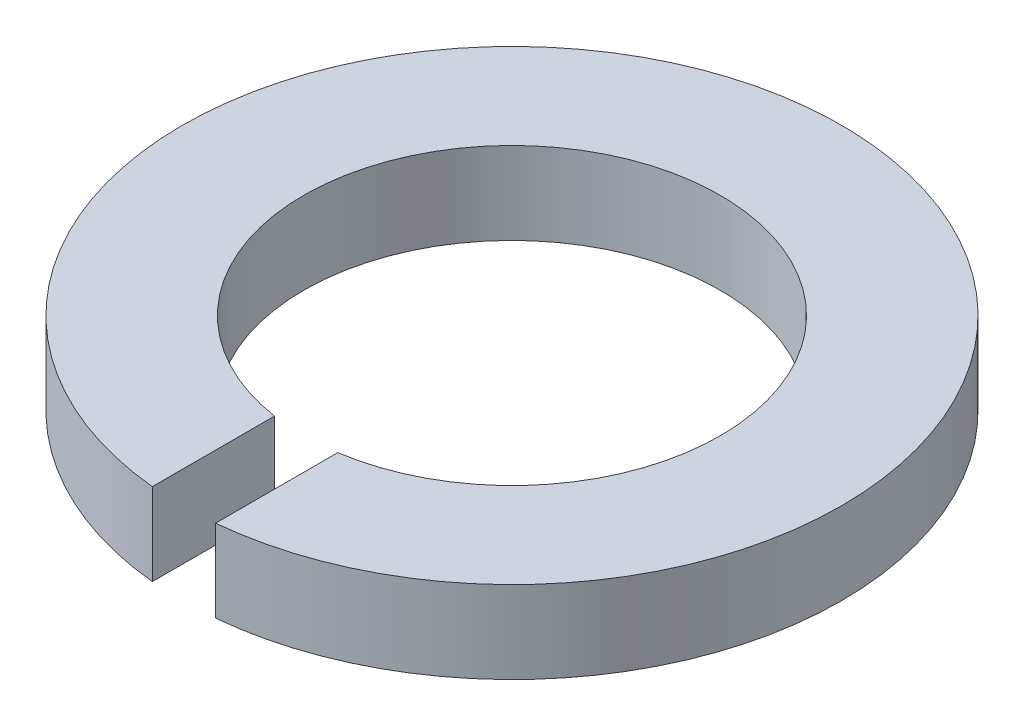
from build123d import *

# Parameters (mm, degrees)
SKETCH1_R          = 15.875
SKETCH1_R_2        = 10.033
EXTRUDE1_DEPTH     = 3.9624
SKETCH2_W          = 3.048
SKETCH2_H          = 19.05
CUT_EXTRUDE1_DEPTH = 23.797628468


with BuildPart() as part:
    # Sketch1 → Extrude1 (new body)
    with BuildSketch(Plane(origin=(0, 0, 0), x_dir=(1, 0, 0), z_dir=(0, 1, 0))):
        with Locations(Location((0, 0, 0), (0, 0, 270))):
            Circle(SKETCH1_R)
        with Locations(Location((0, 0, 0), (0, 0, 270))):
            Circle(SKETCH1_R_2, mode=Mode.SUBTRACT)
    extrude(amount=EXTRUDE1_DEPTH)

    # Sketch2 → Cut-Extrude1 (cut, through all)
    with BuildSketch(Plane(origin=(0, 3.9624, 0), x_dir=(-1, 0, 0), z_dir=(0, 1, 0))):
        with Locations((0, 9.525)):
            Rectangle(SKETCH2_W, SKETCH2_H)
    extrude(amount=-CUT_EXTRUDE1_DEPTH, mode=Mode.SUBTRACT)


solid = part.part
